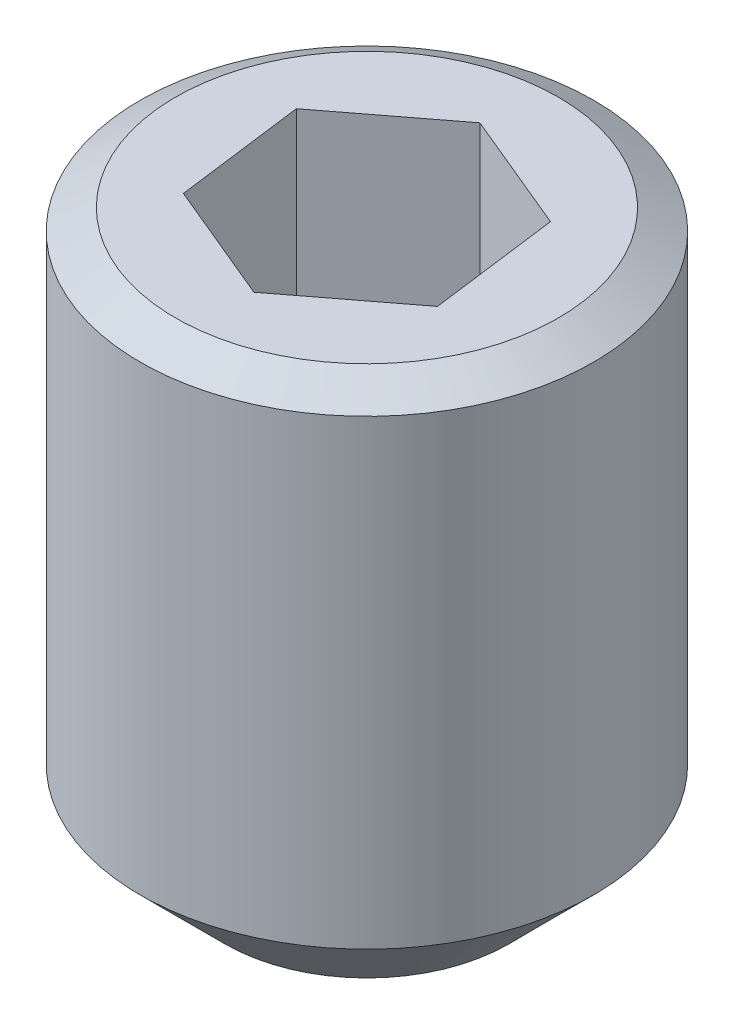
from build123d import *

# Parameters (mm, degrees)
ENL_V_MAT_EXTRU_1_DEPTH = 5


with BuildPart() as part:
    # Esquisse1 → R_volution1 (revolve)
    with BuildSketch(Plane.XY, mode=Mode.PRIVATE) as r_volution1_sk:
        Polygon((0, 0), (2.5, 0), (4, 1.5), (4, 9.639156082), (3.375, 10), (0, 10), align=None)
    revolve(r_volution1_sk.sketch.rotate(Axis((0, 0, 0), (0, 1, 0)), 90), axis=Axis((0, 0, 0), (0, 1, 0)))

    # Esquisse2 → Enl_v. mat.-Extru.1 (cut)
    with BuildSketch(Plane(origin=(0, 10, 0), x_dir=(-1, 0, 0), z_dir=(0, 1, 0))):
        Polygon((1.834490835, 1.402845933), (-0.297654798, 2.290138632), (-2.132145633, 0.8872927), (-1.834490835, -1.402845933), (0.297654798, -2.290138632), (2.132145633, -0.8872927), align=None)
    extrude(amount=-ENL_V_MAT_EXTRU_1_DEPTH, mode=Mode.SUBTRACT)


solid = part.part
